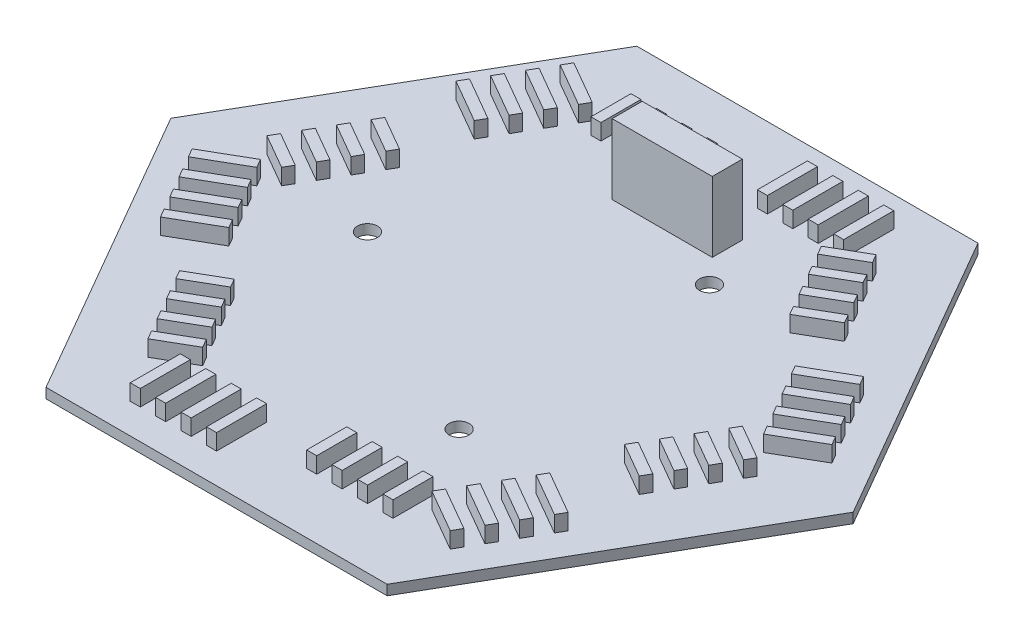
from build123d import *

# Parameters (mm, degrees)
SKETCH1_R           = 1
BOSS_EXTRUDE1_DEPTH = 1
SKETCH2_W           = 10
SKETCH2_H           = 3
BOSS_EXTRUDE2_DEPTH = 7
SKETCH3_W           = 1
SKETCH3_H           = 4
SKETCH3_H_2         = 5
BOSS_EXTRUDE3_DEPTH = 1.6
CIRPATTERN2_COUNT   = 6


with BuildPart() as part:
    # Sketch1 → Boss-Extrude1 (new body)
    with BuildSketch(Plane(origin=(0, 0, 0), x_dir=(1, 0, 0), z_dir=(0, 1, 0))):
        Polygon((34.063665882, 0), (17.031832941, 29.5), (-17.031832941, 29.5), (-34.063665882, 0), (-17.031832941, -29.5), (17.031832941, -29.5), align=None)
        with Locations(Location((7.216878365, 12.5, 0), (0, 0, 270))):
            Circle(SKETCH1_R, mode=Mode.SUBTRACT)
        with Locations(Location((7.216878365, -12.5, 0), (0, 0, 270))):
            Circle(SKETCH1_R, mode=Mode.SUBTRACT)
        with Locations(Location((-14.43375673, 0, 0), (0, 0, 270))):
            Circle(SKETCH1_R, mode=Mode.SUBTRACT)
    extrude(amount=BOSS_EXTRUDE1_DEPTH)

    # Sketch2 → Boss-Extrude2 (add)
    with BuildSketch(Plane(origin=(0, 1, 0), x_dir=(1, 0, 0), z_dir=(0, 1, 0))):
        with Locations((0, 16.5)):
            Rectangle(SKETCH2_W, SKETCH2_H)
    extrude(amount=BOSS_EXTRUDE2_DEPTH)

    # Sketch3 → Boss-Extrude3 (add)
    with BuildSketch(Plane(origin=(0, 1, 0), x_dir=(1, 0, 0), z_dir=(0, 1, 0))):
        with Locations((-6.04, 21.5)):
            Rectangle(SKETCH3_W, SKETCH3_H)
        with Locations((-3.5, 21.5)):
            Rectangle(SKETCH3_W, SKETCH3_H)
        with Locations((-8.58, 21.5)):
            Rectangle(SKETCH3_W, SKETCH3_H)
        with Locations((-11.12, 21.5)):
            Rectangle(SKETCH3_W, SKETCH3_H)
        with Locations((6.04, 24)):
            Rectangle(SKETCH3_W, SKETCH3_H_2)
        with Locations((3.5, 24)):
            Rectangle(SKETCH3_W, SKETCH3_H_2)
        with Locations((8.58, 24)):
            Rectangle(SKETCH3_W, SKETCH3_H_2)
        with Locations((11.12, 24)):
            Rectangle(SKETCH3_W, SKETCH3_H_2)
    boss_extrude3 = extrude(amount=BOSS_EXTRUDE3_DEPTH)

    # CirPattern2: Boss-Extrude3 ×6 about axis
    cirpattern2_axis = Axis((0, 0, 0), (0, 1, 0))
    for i in range(1, CIRPATTERN2_COUNT):
        add(boss_extrude3.rotate(cirpattern2_axis, i * 360 / CIRPATTERN2_COUNT))


solid = part.part
